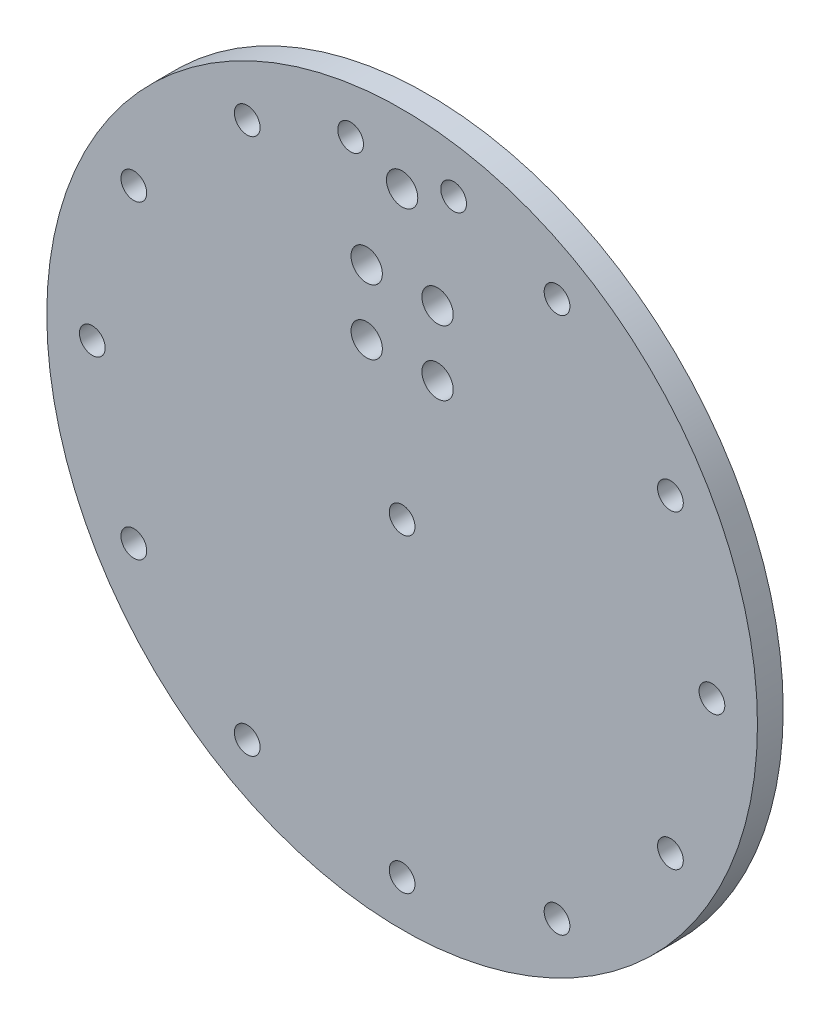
from build123d import *

# Parameters (mm, degrees)
SKETCH2_R           = 43.815
SKETCH2_R_2         = 1.5875
SKETCH2_R_3         = 1.9304
BOSS_EXTRUDE1_DEPTH = 3.175


with BuildPart() as part:
    # Sketch2 → Boss-Extrude1 (new body)
    with BuildSketch(Plane.XY):
        Circle(SKETCH2_R)
        with Locations((-33.082170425, -19.1)):
            Circle(SKETCH2_R_2, mode=Mode.SUBTRACT)
        with Locations((-19.1, -33.082170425)):
            Circle(SKETCH2_R_2, mode=Mode.SUBTRACT)
        with Locations((0, -38.2)):
            Circle(SKETCH2_R_2, mode=Mode.SUBTRACT)
        with Locations((19.1, -33.082170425)):
            Circle(SKETCH2_R_2, mode=Mode.SUBTRACT)
        with Locations((33.082170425, -19.1)):
            Circle(SKETCH2_R_2, mode=Mode.SUBTRACT)
        with Locations((38.2, 0)):
            Circle(SKETCH2_R_2, mode=Mode.SUBTRACT)
        with Locations((-38.2, 0)):
            Circle(SKETCH2_R_2, mode=Mode.SUBTRACT)
        with Locations((-33.082170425, 19.1)):
            Circle(SKETCH2_R_2, mode=Mode.SUBTRACT)
        with Locations((-19.1, 33.082170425)):
            Circle(SKETCH2_R_2, mode=Mode.SUBTRACT)
        with Locations((33.082170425, 19.1)):
            Circle(SKETCH2_R_2, mode=Mode.SUBTRACT)
        with Locations((19.1, 33.082170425)):
            Circle(SKETCH2_R_2, mode=Mode.SUBTRACT)
        with Locations((-6.35, 37.668521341)):
            Circle(SKETCH2_R_2, mode=Mode.SUBTRACT)
        with Locations((-4.3688, 17)):
            Circle(SKETCH2_R_3, mode=Mode.SUBTRACT)
        with Locations((-4.3688, 25)):
            Circle(SKETCH2_R_3, mode=Mode.SUBTRACT)
        with Locations((4.3688, 25)):
            Circle(SKETCH2_R_3, mode=Mode.SUBTRACT)
        with Locations((4.3688, 17)):
            Circle(SKETCH2_R_3, mode=Mode.SUBTRACT)
        with Locations((0, 35.292411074)):
            Circle(SKETCH2_R_3, mode=Mode.SUBTRACT)
        with Locations((6.35, 37.668521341)):
            Circle(SKETCH2_R_2, mode=Mode.SUBTRACT)
        Circle(SKETCH2_R_2, mode=Mode.SUBTRACT)
    extrude(amount=BOSS_EXTRUDE1_DEPTH)


solid = part.part
